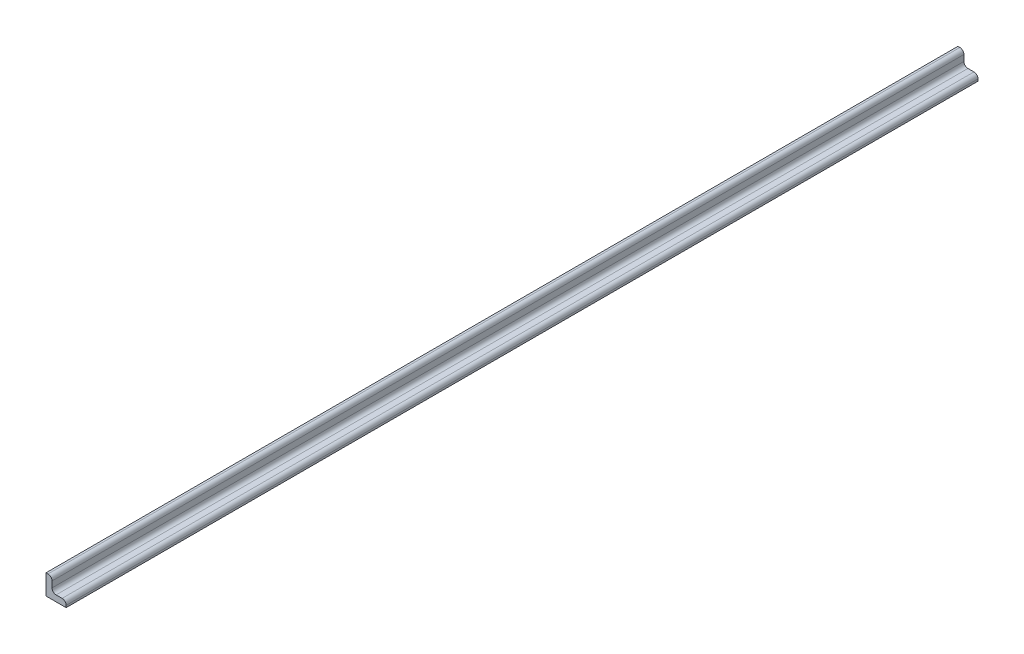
from build123d import *

# Parameters (mm, degrees)
BASE_EXTRUSION_DEPTH = 453


with BuildPart() as part:
    # Esquisse1 → Base-Extrusion (new body)
    with BuildSketch(Plane.XY):
        with BuildLine():
            Line((0, 10), (0, 0))
            Line((0, 0), (10, 0))
            Line((10, 0), (10, 1))
            ThreePointArc((10, 1), (9.414213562, 2.414213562), (8, 3))
            Line((8, 3), (5, 3))
            ThreePointArc((5, 3), (3.585786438, 3.585786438), (3, 5))
            Line((3, 5), (3, 8))
            ThreePointArc((3, 8), (2.414213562, 9.414213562), (1, 10))
            Line((1, 10), (0, 10))
        make_face()
    extrude(amount=BASE_EXTRUSION_DEPTH)


solid = part.part
